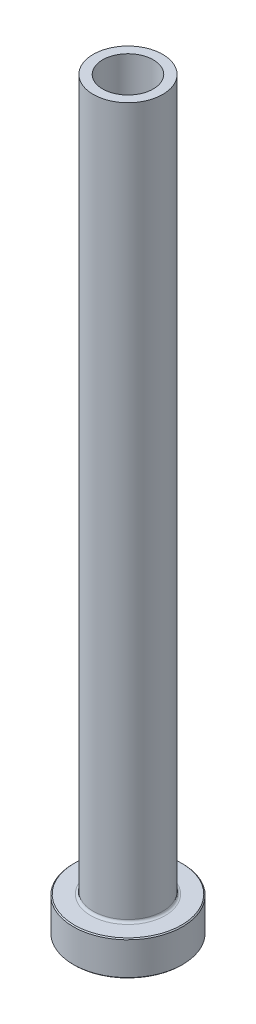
from build123d import *

# Parameters (mm, degrees)
FILLET1_R     = 0.5
CHAMFER1_SIZE = 0.2
CHAMFER3_SIZE = 0.5


with BuildPart() as part:
    # Sketch1 → Revolve1 (revolve)
    with BuildSketch(Plane.XY, mode=Mode.PRIVATE) as revolve1_sk:
        Polygon((-5.1, 150), (-7, 150), (-7, 7), (-11, 7), (-11, 0), (-5.35, 0), (-5.35, 83), (-5.1, 95), align=None)
    revolve(revolve1_sk.sketch.rotate(Axis((0, 92.187680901, 0), (0, -1, 0)), 270), axis=Axis((0, 92.187680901, 0), (0, -1, 0)))

    # Fillet1
    fillet1_edges = [part.edges().sort_by_distance(p)[0] for p in [
        (0, 7, -7),
    ]]
    fillet(fillet1_edges, radius=FILLET1_R)

    # Chamfer1
    chamfer1_edges = [part.edges().sort_by_distance(p)[0] for p in [
        (0, 0, -11),
        (0, 7, -11),
    ]]
    chamfer(chamfer1_edges, length=CHAMFER1_SIZE)

    # Chamfer3
    chamfer3_edges = [part.edges().sort_by_distance(p)[0] for p in [
        (0, 0, -5.35),
    ]]
    chamfer(chamfer3_edges, length=CHAMFER3_SIZE)


solid = part.part
